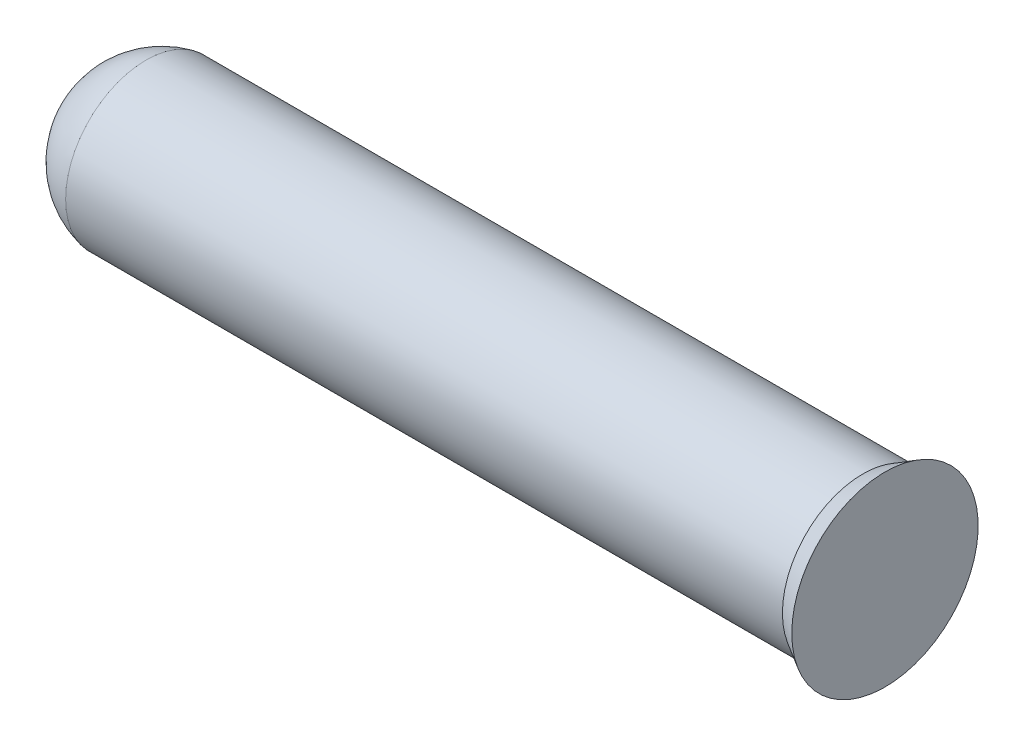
from build123d import *


with BuildPart() as part:
    # Sketch1 → Revolve1 (revolve)
    with BuildSketch(Plane.XY, mode=Mode.PRIVATE) as revolve1_sk:
        with BuildLine():
            Line((0, 0), (19.964, 0))
            Line((19.964, 0), (19.964, 2.311))
            Line((19.964, 2.311), (19.414939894, 1.994))
            Line((19.414939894, 1.994), (1.640863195, 1.994))
            ThreePointArc((1.640863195, 1.994), (0.462953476, 1.291168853), (0, 0))
        make_face()
    revolve(revolve1_sk.sketch.rotate(Axis((0, 0, 0), (1, 0, 0)), 90), axis=Axis((0, 0, 0), (1, 0, 0)))


solid = part.part
